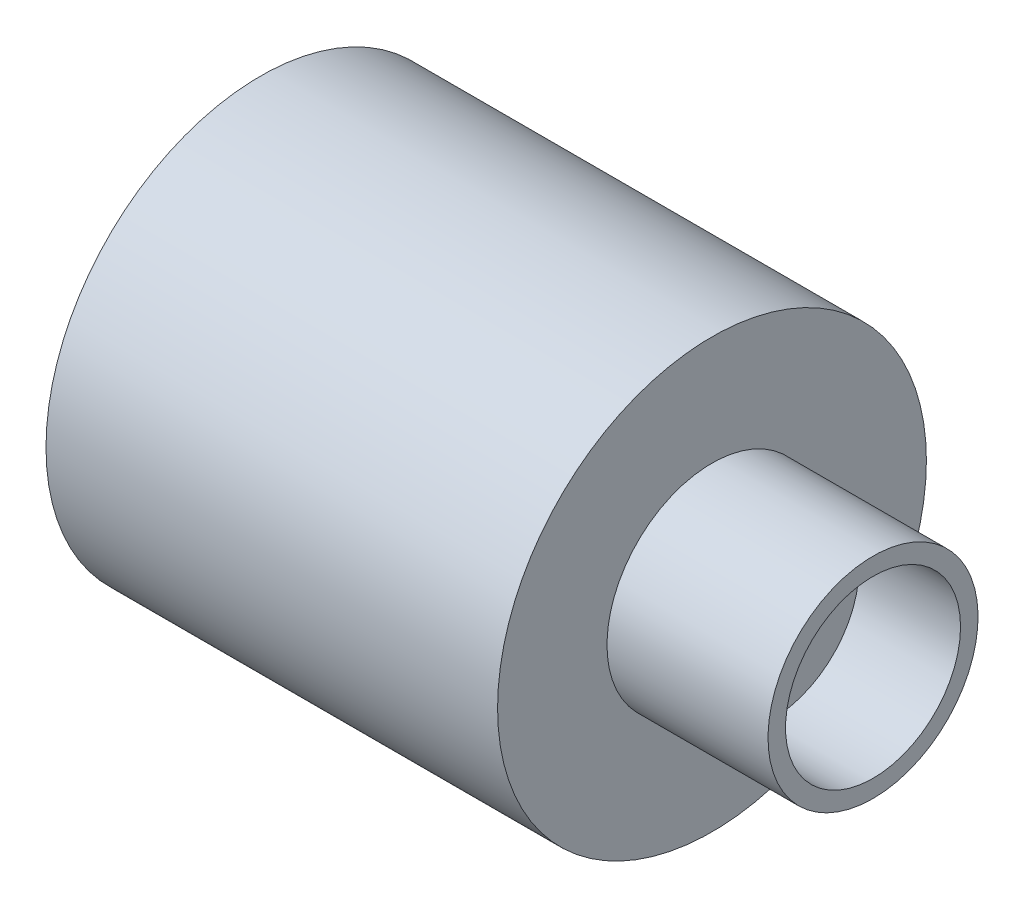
ISO-10303-21;
HEADER;
FILE_DESCRIPTION(('STEP AP214'),'2;1');
FILE_NAME('part.step','',(''),(''),'','','');
FILE_SCHEMA(('AUTOMOTIVE_DESIGN { 1 0 10303 214 1 1 1 1 }'));
ENDSEC;
DATA;
#1=APPLICATION_CONTEXT('core data for automotive mechanical design processes');
#2=APPLICATION_PROTOCOL_DEFINITION('international standard','automotive_design',2000,#1);
#3=PRODUCT_CONTEXT('',#1,'mechanical');
#4=PRODUCT('Part','Part','',(#3));
#5=PRODUCT_RELATED_PRODUCT_CATEGORY('part','',(#4));
#6=PRODUCT_DEFINITION_FORMATION('','',#4);
#7=PRODUCT_DEFINITION_CONTEXT('part definition',#1,'design');
#8=PRODUCT_DEFINITION('design','',#6,#7);
#9=PRODUCT_DEFINITION_SHAPE('','',#8);
#10=(LENGTH_UNIT() NAMED_UNIT(*) SI_UNIT(.MILLI.,.METRE.));
#11=(NAMED_UNIT(*) PLANE_ANGLE_UNIT() SI_UNIT($,.RADIAN.));
#12=(NAMED_UNIT(*) SI_UNIT($,.STERADIAN.) SOLID_ANGLE_UNIT());
#13=UNCERTAINTY_MEASURE_WITH_UNIT(LENGTH_MEASURE(1.E-05),#10,'distance_accuracy_value','');
#14=(GEOMETRIC_REPRESENTATION_CONTEXT(3) GLOBAL_UNCERTAINTY_ASSIGNED_CONTEXT((#13)) GLOBAL_UNIT_ASSIGNED_CONTEXT((#10,
#11,#12)) REPRESENTATION_CONTEXT('',''));
#15=CARTESIAN_POINT('',(0.,0.,0.));
#16=DIRECTION('',(0.,0.,1.));
#17=DIRECTION('',(1.,0.,0.));
#18=AXIS2_PLACEMENT_3D('',#15,#16,#17);
#19=CARTESIAN_POINT('',(-14.5,0.,0.));
#20=DIRECTION('',(1.,0.,0.));
#21=DIRECTION('',(0.,0.,-1.));
#22=AXIS2_PLACEMENT_3D('',#19,#20,#21);
#23=CYLINDRICAL_SURFACE('',#22,3.75);
#24=CARTESIAN_POINT('',(-14.5,0.,0.));
#25=DIRECTION('',(1.,0.,0.));
#26=DIRECTION('',(0.,0.,-1.));
#27=AXIS2_PLACEMENT_3D('',#24,#25,#26);
#28=CIRCLE('',#27,3.75);
#29=CARTESIAN_POINT('',(-14.5,0.,-3.75));
#30=VERTEX_POINT('',#29);
#31=EDGE_CURVE('E19',#30,#30,#28,.F.);
#32=ORIENTED_EDGE('',*,*,#31,.F.);
#33=EDGE_LOOP('',(#32));
#34=FACE_BOUND('',#33,.T.);
#35=CARTESIAN_POINT('',(-14.,0.,0.));
#36=DIRECTION('',(1.,0.,0.));
#37=DIRECTION('',(0.,0.,-1.));
#38=AXIS2_PLACEMENT_3D('',#35,#36,#37);
#39=CIRCLE('',#38,3.75);
#40=CARTESIAN_POINT('',(-14.,0.,-3.75));
#41=VERTEX_POINT('',#40);
#42=EDGE_CURVE('E53',#41,#41,#39,.F.);
#43=ORIENTED_EDGE('',*,*,#42,.T.);
#44=EDGE_LOOP('',(#43));
#45=FACE_BOUND('',#44,.T.);
#46=ADVANCED_FACE('F15',(#34,#45),#23,.T.);
#47=CARTESIAN_POINT('',(-14.5,-3.795,-3.795));
#48=DIRECTION('',(-1.,0.,0.));
#49=DIRECTION('',(0.,0.,1.));
#50=AXIS2_PLACEMENT_3D('',#47,#48,#49);
#51=PLANE('',#50);
#52=CARTESIAN_POINT('',(-14.5,0.,0.));
#53=DIRECTION('',(-1.,0.,0.));
#54=DIRECTION('',(0.,0.,1.));
#55=AXIS2_PLACEMENT_3D('',#52,#53,#54);
#56=CIRCLE('',#55,2.5);
#57=CARTESIAN_POINT('',(-14.5,0.,2.5));
#58=VERTEX_POINT('',#57);
#59=EDGE_CURVE('E51',#58,#58,#56,.T.);
#60=ORIENTED_EDGE('',*,*,#59,.F.);
#61=EDGE_LOOP('',(#60));
#62=FACE_BOUND('',#61,.T.);
#63=ORIENTED_EDGE('',*,*,#31,.T.);
#64=EDGE_LOOP('',(#63));
#65=FACE_BOUND('',#64,.T.);
#66=ADVANCED_FACE('F60',(#62,#65),#51,.T.);
#67=CARTESIAN_POINT('',(-14.,-6.1985,6.1985));
#68=DIRECTION('',(1.,0.,0.));
#69=DIRECTION('',(0.,0.,-1.));
#70=AXIS2_PLACEMENT_3D('',#67,#68,#69);
#71=PLANE('',#70);
#72=ORIENTED_EDGE('',*,*,#42,.F.);
#73=EDGE_LOOP('',(#72));
#74=FACE_BOUND('',#73,.T.);
#75=CARTESIAN_POINT('',(-14.,0.,0.));
#76=DIRECTION('',(-1.,0.,0.));
#77=DIRECTION('',(0.,0.,1.));
#78=AXIS2_PLACEMENT_3D('',#75,#76,#77);
#79=CIRCLE('',#78,6.125);
#80=CARTESIAN_POINT('',(-14.,0.,6.125));
#81=VERTEX_POINT('',#80);
#82=EDGE_CURVE('E48',#81,#81,#79,.T.);
#83=ORIENTED_EDGE('',*,*,#82,.T.);
#84=EDGE_LOOP('',(#83));
#85=FACE_BOUND('',#84,.T.);
#86=ADVANCED_FACE('F69',(#74,#85),#71,.F.);
#87=CARTESIAN_POINT('',(-12.,0.,0.));
#88=DIRECTION('',(-1.,0.,0.));
#89=DIRECTION('',(0.,0.,1.));
#90=AXIS2_PLACEMENT_3D('',#87,#88,#89);
#91=CYLINDRICAL_SURFACE('',#90,2.5);
#92=ORIENTED_EDGE('',*,*,#59,.T.);
#93=EDGE_LOOP('',(#92));
#94=FACE_BOUND('',#93,.T.);
#95=CARTESIAN_POINT('',(-12.,0.,0.));
#96=DIRECTION('',(-1.,0.,0.));
#97=DIRECTION('',(0.,0.,1.));
#98=AXIS2_PLACEMENT_3D('',#95,#96,#97);
#99=CIRCLE('',#98,2.5);
#100=CARTESIAN_POINT('',(-12.,0.,2.5));
#101=VERTEX_POINT('',#100);
#102=EDGE_CURVE('E45',#101,#101,#99,.T.);
#103=ORIENTED_EDGE('',*,*,#102,.F.);
#104=EDGE_LOOP('',(#103));
#105=FACE_BOUND('',#104,.T.);
#106=ADVANCED_FACE('F89',(#94,#105),#91,.F.);
#107=CARTESIAN_POINT('',(-1.1,0.,0.));
#108=DIRECTION('',(-1.,0.,0.));
#109=DIRECTION('',(0.,0.,1.));
#110=AXIS2_PLACEMENT_3D('',#107,#108,#109);
#111=CYLINDRICAL_SURFACE('',#110,6.125);
#112=ORIENTED_EDGE('',*,*,#82,.F.);
#113=EDGE_LOOP('',(#112));
#114=FACE_BOUND('',#113,.T.);
#115=CARTESIAN_POINT('',(-1.1,0.,0.));
#116=DIRECTION('',(-1.,0.,0.));
#117=DIRECTION('',(0.,0.,1.));
#118=AXIS2_PLACEMENT_3D('',#115,#116,#117);
#119=CIRCLE('',#118,6.125);
#120=CARTESIAN_POINT('',(-1.1,0.,6.125));
#121=VERTEX_POINT('',#120);
#122=EDGE_CURVE('E42',#121,#121,#119,.F.);
#123=ORIENTED_EDGE('',*,*,#122,.F.);
#124=EDGE_LOOP('',(#123));
#125=FACE_BOUND('',#124,.T.);
#126=ADVANCED_FACE('F95',(#114,#125),#111,.T.);
#127=CARTESIAN_POINT('',(-12.,-2.53,-2.53));
#128=DIRECTION('',(-1.,0.,0.));
#129=DIRECTION('',(0.,0.,1.));
#130=AXIS2_PLACEMENT_3D('',#127,#128,#129);
#131=PLANE('',#130);
#132=CARTESIAN_POINT('',(-12.,0.,0.));
#133=DIRECTION('',(-1.,0.,0.));
#134=DIRECTION('',(0.,0.,1.));
#135=AXIS2_PLACEMENT_3D('',#132,#133,#134);
#136=CIRCLE('',#135,1.5);
#137=CARTESIAN_POINT('',(-12.,0.,1.5));
#138=VERTEX_POINT('',#137);
#139=EDGE_CURVE('E39',#138,#138,#136,.T.);
#140=ORIENTED_EDGE('',*,*,#139,.F.);
#141=EDGE_LOOP('',(#140));
#142=FACE_BOUND('',#141,.T.);
#143=ORIENTED_EDGE('',*,*,#102,.T.);
#144=EDGE_LOOP('',(#143));
#145=FACE_BOUND('',#144,.T.);
#146=ADVANCED_FACE('F91',(#142,#145),#131,.T.);
#147=CARTESIAN_POINT('',(-1.1,-6.1985,6.1985));
#148=DIRECTION('',(1.,0.,0.));
#149=DIRECTION('',(0.,0.,-1.));
#150=AXIS2_PLACEMENT_3D('',#147,#148,#149);
#151=PLANE('',#150);
#152=CARTESIAN_POINT('',(-1.1,0.,0.));
#153=DIRECTION('',(-1.,0.,0.));
#154=DIRECTION('',(0.,-1.,0.));
#155=AXIS2_PLACEMENT_3D('',#152,#153,#154);
#156=CIRCLE('',#155,3.);
#157=CARTESIAN_POINT('',(-1.1,-3.,0.));
#158=VERTEX_POINT('',#157);
#159=EDGE_CURVE('E36',#158,#158,#156,.T.);
#160=ORIENTED_EDGE('',*,*,#159,.T.);
#161=EDGE_LOOP('',(#160));
#162=FACE_BOUND('',#161,.T.);
#163=ORIENTED_EDGE('',*,*,#122,.T.);
#164=EDGE_LOOP('',(#163));
#165=FACE_BOUND('',#164,.T.);
#166=ADVANCED_FACE('F94',(#162,#165),#151,.T.);
#167=CARTESIAN_POINT('',(0.6,0.,0.));
#168=DIRECTION('',(-1.,0.,0.));
#169=DIRECTION('',(0.,0.,1.));
#170=AXIS2_PLACEMENT_3D('',#167,#168,#169);
#171=CYLINDRICAL_SURFACE('',#170,1.5);
#172=ORIENTED_EDGE('',*,*,#139,.T.);
#173=EDGE_LOOP('',(#172));
#174=FACE_BOUND('',#173,.T.);
#175=CARTESIAN_POINT('',(0.6,0.,0.));
#176=DIRECTION('',(-1.,0.,0.));
#177=DIRECTION('',(0.,0.,1.));
#178=AXIS2_PLACEMENT_3D('',#175,#176,#177);
#179=CIRCLE('',#178,1.5);
#180=CARTESIAN_POINT('',(0.6,0.,1.5));
#181=VERTEX_POINT('',#180);
#182=EDGE_CURVE('E33',#181,#181,#179,.T.);
#183=ORIENTED_EDGE('',*,*,#182,.F.);
#184=EDGE_LOOP('',(#183));
#185=FACE_BOUND('',#184,.T.);
#186=ADVANCED_FACE('F98',(#174,#185),#171,.F.);
#187=CARTESIAN_POINT('',(3.5,0.,0.));
#188=DIRECTION('',(-1.,0.,0.));
#189=DIRECTION('',(0.,-1.,0.));
#190=AXIS2_PLACEMENT_3D('',#187,#188,#189);
#191=CYLINDRICAL_SURFACE('',#190,3.);
#192=ORIENTED_EDGE('',*,*,#159,.F.);
#193=EDGE_LOOP('',(#192));
#194=FACE_BOUND('',#193,.T.);
#195=CARTESIAN_POINT('',(3.5,0.,0.));
#196=DIRECTION('',(-1.,0.,0.));
#197=DIRECTION('',(0.,-1.,0.));
#198=AXIS2_PLACEMENT_3D('',#195,#196,#197);
#199=CIRCLE('',#198,3.);
#200=CARTESIAN_POINT('',(3.5,-3.,0.));
#201=VERTEX_POINT('',#200);
#202=EDGE_CURVE('E28',#201,#201,#199,.F.);
#203=ORIENTED_EDGE('',*,*,#202,.F.);
#204=EDGE_LOOP('',(#203));
#205=FACE_BOUND('',#204,.T.);
#206=ADVANCED_FACE('F84',(#194,#205),#191,.T.);
#207=CARTESIAN_POINT('',(0.6,-2.53,2.53));
#208=DIRECTION('',(1.,0.,0.));
#209=DIRECTION('',(0.,0.,-1.));
#210=AXIS2_PLACEMENT_3D('',#207,#208,#209);
#211=PLANE('',#210);
#212=ORIENTED_EDGE('',*,*,#182,.T.);
#213=EDGE_LOOP('',(#212));
#214=FACE_BOUND('',#213,.T.);
#215=CARTESIAN_POINT('',(0.6,0.,0.));
#216=DIRECTION('',(1.,0.,0.));
#217=DIRECTION('',(0.,0.,-1.));
#218=AXIS2_PLACEMENT_3D('',#215,#216,#217);
#219=CIRCLE('',#218,2.5);
#220=CARTESIAN_POINT('',(0.6,0.,-2.5));
#221=VERTEX_POINT('',#220);
#222=EDGE_CURVE('E23',#221,#221,#219,.F.);
#223=ORIENTED_EDGE('',*,*,#222,.F.);
#224=EDGE_LOOP('',(#223));
#225=FACE_BOUND('',#224,.T.);
#226=ADVANCED_FACE('F80',(#214,#225),#211,.T.);
#227=CARTESIAN_POINT('',(3.5,-3.036,3.036));
#228=DIRECTION('',(1.,0.,0.));
#229=DIRECTION('',(0.,0.,-1.));
#230=AXIS2_PLACEMENT_3D('',#227,#228,#229);
#231=PLANE('',#230);
#232=CARTESIAN_POINT('',(3.5,0.,0.));
#233=DIRECTION('',(1.,0.,0.));
#234=DIRECTION('',(0.,0.,-1.));
#235=AXIS2_PLACEMENT_3D('',#232,#233,#234);
#236=CIRCLE('',#235,2.5);
#237=CARTESIAN_POINT('',(3.5,0.,-2.5));
#238=VERTEX_POINT('',#237);
#239=EDGE_CURVE('E10',#238,#238,#236,.T.);
#240=ORIENTED_EDGE('',*,*,#239,.F.);
#241=EDGE_LOOP('',(#240));
#242=FACE_BOUND('',#241,.T.);
#243=ORIENTED_EDGE('',*,*,#202,.T.);
#244=EDGE_LOOP('',(#243));
#245=FACE_BOUND('',#244,.T.);
#246=ADVANCED_FACE('F17',(#242,#245),#231,.T.);
#247=CARTESIAN_POINT('',(0.6,0.,0.));
#248=DIRECTION('',(1.,0.,0.));
#249=DIRECTION('',(0.,0.,-1.));
#250=AXIS2_PLACEMENT_3D('',#247,#248,#249);
#251=CYLINDRICAL_SURFACE('',#250,2.5);
#252=ORIENTED_EDGE('',*,*,#239,.T.);
#253=EDGE_LOOP('',(#252));
#254=FACE_BOUND('',#253,.T.);
#255=ORIENTED_EDGE('',*,*,#222,.T.);
#256=EDGE_LOOP('',(#255));
#257=FACE_BOUND('',#256,.T.);
#258=ADVANCED_FACE('F73',(#254,#257),#251,.F.);
#259=CLOSED_SHELL('',(#46,#66,#86,#106,#126,#146,#166,#186,#206,#226,#246,#258));
#260=MANIFOLD_SOLID_BREP('B1',#259);
#261=ADVANCED_BREP_SHAPE_REPRESENTATION('',(#18,#260),#14);
#262=SHAPE_DEFINITION_REPRESENTATION(#9,#261);
ENDSEC;
END-ISO-10303-21;
